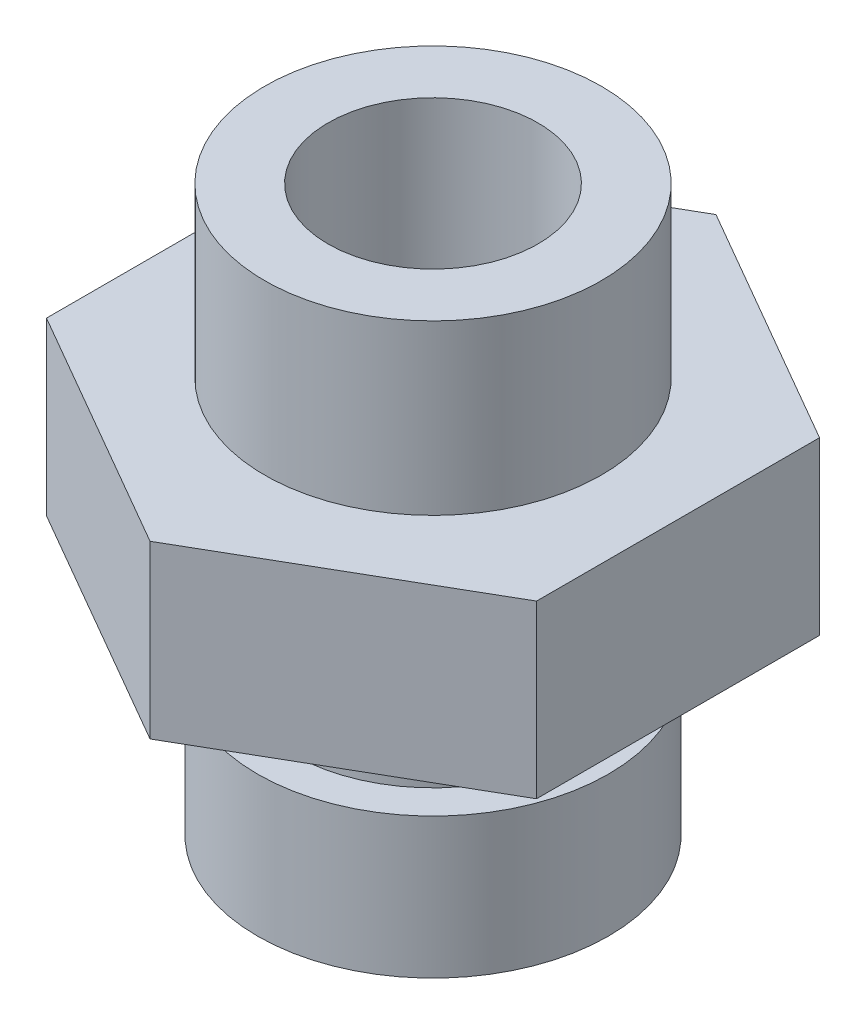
ISO-10303-21;
HEADER;
FILE_DESCRIPTION(('STEP AP214'),'2;1');
FILE_NAME('part.step','',(''),(''),'','','');
FILE_SCHEMA(('AUTOMOTIVE_DESIGN { 1 0 10303 214 1 1 1 1 }'));
ENDSEC;
DATA;
#1=APPLICATION_CONTEXT('core data for automotive mechanical design processes');
#2=APPLICATION_PROTOCOL_DEFINITION('international standard','automotive_design',2000,#1);
#3=PRODUCT_CONTEXT('',#1,'mechanical');
#4=PRODUCT('Part','Part','',(#3));
#5=PRODUCT_RELATED_PRODUCT_CATEGORY('part','',(#4));
#6=PRODUCT_DEFINITION_FORMATION('','',#4);
#7=PRODUCT_DEFINITION_CONTEXT('part definition',#1,'design');
#8=PRODUCT_DEFINITION('design','',#6,#7);
#9=PRODUCT_DEFINITION_SHAPE('','',#8);
#10=(LENGTH_UNIT() NAMED_UNIT(*) SI_UNIT(.MILLI.,.METRE.));
#11=(NAMED_UNIT(*) PLANE_ANGLE_UNIT() SI_UNIT($,.RADIAN.));
#12=(NAMED_UNIT(*) SI_UNIT($,.STERADIAN.) SOLID_ANGLE_UNIT());
#13=UNCERTAINTY_MEASURE_WITH_UNIT(LENGTH_MEASURE(1.E-05),#10,'distance_accuracy_value','');
#14=(GEOMETRIC_REPRESENTATION_CONTEXT(3) GLOBAL_UNCERTAINTY_ASSIGNED_CONTEXT((#13)) GLOBAL_UNIT_ASSIGNED_CONTEXT((#10,
#11,#12)) REPRESENTATION_CONTEXT('',''));
#15=CARTESIAN_POINT('',(0.,0.,0.));
#16=DIRECTION('',(0.,0.,1.));
#17=DIRECTION('',(1.,0.,0.));
#18=AXIS2_PLACEMENT_3D('',#15,#16,#17);
#19=CARTESIAN_POINT('',(0.,-5.08,0.));
#20=DIRECTION('',(0.,1.,0.));
#21=DIRECTION('',(0.,0.,1.));
#22=AXIS2_PLACEMENT_3D('',#19,#20,#21);
#23=CYLINDRICAL_SURFACE('',#22,1.7272);
#24=CARTESIAN_POINT('',(0.,-5.08,0.));
#25=DIRECTION('',(0.,1.,0.));
#26=DIRECTION('',(0.,0.,1.));
#27=AXIS2_PLACEMENT_3D('',#24,#25,#26);
#28=CIRCLE('',#27,1.7272);
#29=CARTESIAN_POINT('',(0.,-5.08,1.7272));
#30=VERTEX_POINT('',#29);
#31=EDGE_CURVE('E309',#30,#30,#28,.T.);
#32=ORIENTED_EDGE('',*,*,#31,.F.);
#33=EDGE_LOOP('',(#32));
#34=FACE_BOUND('',#33,.T.);
#35=CARTESIAN_POINT('',(0.,2.6035,0.));
#36=DIRECTION('',(0.,1.,0.));
#37=DIRECTION('',(0.,0.,1.));
#38=AXIS2_PLACEMENT_3D('',#35,#36,#37);
#39=CIRCLE('',#38,1.7272);
#40=CARTESIAN_POINT('',(0.,2.6035,1.7272));
#41=VERTEX_POINT('',#40);
#42=EDGE_CURVE('E38',#41,#41,#39,.F.);
#43=ORIENTED_EDGE('',*,*,#42,.F.);
#44=EDGE_LOOP('',(#43));
#45=FACE_BOUND('',#44,.T.);
#46=ADVANCED_FACE('F34',(#34,#45),#23,.F.);
#47=CARTESIAN_POINT('',(-5.54355000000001,3.8735,-3.20057008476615));
#48=DIRECTION('',(0.,1.,0.));
#49=DIRECTION('',(0.,0.,1.));
#50=AXIS2_PLACEMENT_3D('',#47,#48,#49);
#51=PLANE('',#50);
#52=DIRECTION('',(0.,0.,1.));
#53=VECTOR('',#52,1.);
#54=CARTESIAN_POINT('',(-5.54355000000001,3.8735,3.20057008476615));
#55=LINE('',#54,#53);
#56=CARTESIAN_POINT('',(-5.54355000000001,3.8735,-3.20057008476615));
#57=VERTEX_POINT('',#56);
#58=CARTESIAN_POINT('',(-5.54355000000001,3.8735,3.20057008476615));
#59=VERTEX_POINT('',#58);
#60=EDGE_CURVE('E125',#57,#59,#55,.T.);
#61=ORIENTED_EDGE('',*,*,#60,.T.);
#62=DIRECTION('',(0.866025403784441,0.,0.499999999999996));
#63=VECTOR('',#62,1.);
#64=CARTESIAN_POINT('',(-2.77177499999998,3.8735,4.80085512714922));
#65=LINE('',#64,#63);
#66=CARTESIAN_POINT('',(0.,3.8735,6.40114016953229));
#67=VERTEX_POINT('',#66);
#68=EDGE_CURVE('E102',#59,#67,#65,.T.);
#69=ORIENTED_EDGE('',*,*,#68,.T.);
#70=DIRECTION('',(0.866025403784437,0.,-0.500000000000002));
#71=VECTOR('',#70,1.);
#72=CARTESIAN_POINT('',(2.77177499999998,3.8735,4.80085512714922));
#73=LINE('',#72,#71);
#74=CARTESIAN_POINT('',(5.54354999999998,3.8735,3.20057008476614));
#75=VERTEX_POINT('',#74);
#76=EDGE_CURVE('E128',#67,#75,#73,.T.);
#77=ORIENTED_EDGE('',*,*,#76,.T.);
#78=DIRECTION('',(0.,0.,-1.));
#79=VECTOR('',#78,1.);
#80=CARTESIAN_POINT('',(5.54354999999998,3.8735,3.20057008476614));
#81=LINE('',#80,#79);
#82=CARTESIAN_POINT('',(5.54354999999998,3.8735,-3.20057008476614));
#83=VERTEX_POINT('',#82);
#84=EDGE_CURVE('E130',#75,#83,#81,.T.);
#85=ORIENTED_EDGE('',*,*,#84,.T.);
#86=DIRECTION('',(-0.866025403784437,0.,-0.500000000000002));
#87=VECTOR('',#86,1.);
#88=CARTESIAN_POINT('',(2.77177499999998,3.8735,-4.80085512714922));
#89=LINE('',#88,#87);
#90=CARTESIAN_POINT('',(0.,3.8735,-6.40114016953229));
#91=VERTEX_POINT('',#90);
#92=EDGE_CURVE('E55',#83,#91,#89,.T.);
#93=ORIENTED_EDGE('',*,*,#92,.T.);
#94=DIRECTION('',(-0.86602540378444,0.,0.499999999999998));
#95=VECTOR('',#94,1.);
#96=CARTESIAN_POINT('',(-2.77177499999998,3.8735,-4.80085512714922));
#97=LINE('',#96,#95);
#98=EDGE_CURVE('E50',#91,#57,#97,.T.);
#99=ORIENTED_EDGE('',*,*,#98,.T.);
#100=EDGE_LOOP('',(#61,#69,#77,#85,#93,#99));
#101=FACE_BOUND('',#100,.T.);
#102=CARTESIAN_POINT('',(0.,3.8735,0.));
#103=DIRECTION('',(0.,1.,0.));
#104=DIRECTION('',(0.,0.,1.));
#105=AXIS2_PLACEMENT_3D('',#102,#103,#104);
#106=CIRCLE('',#105,3.81);
#107=CARTESIAN_POINT('',(0.,3.8735,-3.81));
#108=VERTEX_POINT('',#107);
#109=EDGE_CURVE('E312',#108,#108,#106,.T.);
#110=ORIENTED_EDGE('',*,*,#109,.F.);
#111=EDGE_LOOP('',(#110));
#112=FACE_BOUND('',#111,.T.);
#113=ADVANCED_FACE('F149',(#101,#112),#51,.T.);
#114=CARTESIAN_POINT('',(-5.54355000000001,0.,-3.20057008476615));
#115=DIRECTION('',(0.,1.,0.));
#116=DIRECTION('',(0.,0.,1.));
#117=AXIS2_PLACEMENT_3D('',#114,#115,#116);
#118=PLANE('',#117);
#119=DIRECTION('',(0.,0.,1.));
#120=VECTOR('',#119,1.);
#121=CARTESIAN_POINT('',(-5.54355000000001,0.,3.20057008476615));
#122=LINE('',#121,#120);
#123=CARTESIAN_POINT('',(-5.54355000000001,0.,-3.20057008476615));
#124=VERTEX_POINT('',#123);
#125=CARTESIAN_POINT('',(-5.54355000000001,0.,3.20057008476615));
#126=VERTEX_POINT('',#125);
#127=EDGE_CURVE('E93',#124,#126,#122,.T.);
#128=ORIENTED_EDGE('',*,*,#127,.F.);
#129=DIRECTION('',(-0.866025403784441,0.,0.499999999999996));
#130=VECTOR('',#129,1.);
#131=CARTESIAN_POINT('',(-2.77177499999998,0.,-4.80085512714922));
#132=LINE('',#131,#130);
#133=CARTESIAN_POINT('',(0.,0.,-6.40114016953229));
#134=VERTEX_POINT('',#133);
#135=EDGE_CURVE('E123',#134,#124,#132,.T.);
#136=ORIENTED_EDGE('',*,*,#135,.F.);
#137=DIRECTION('',(-0.866025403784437,0.,-0.500000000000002));
#138=VECTOR('',#137,1.);
#139=CARTESIAN_POINT('',(2.77177499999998,0.,-4.80085512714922));
#140=LINE('',#139,#138);
#141=CARTESIAN_POINT('',(5.54354999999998,0.,-3.20057008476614));
#142=VERTEX_POINT('',#141);
#143=EDGE_CURVE('E120',#142,#134,#140,.T.);
#144=ORIENTED_EDGE('',*,*,#143,.F.);
#145=DIRECTION('',(0.,0.,-1.));
#146=VECTOR('',#145,1.);
#147=CARTESIAN_POINT('',(5.54354999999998,0.,3.20057008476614));
#148=LINE('',#147,#146);
#149=CARTESIAN_POINT('',(5.54354999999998,0.,3.20057008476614));
#150=VERTEX_POINT('',#149);
#151=EDGE_CURVE('E117',#150,#142,#148,.T.);
#152=ORIENTED_EDGE('',*,*,#151,.F.);
#153=DIRECTION('',(0.866025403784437,0.,-0.500000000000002));
#154=VECTOR('',#153,1.);
#155=CARTESIAN_POINT('',(2.77177499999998,0.,4.80085512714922));
#156=LINE('',#155,#154);
#157=CARTESIAN_POINT('',(0.,0.,6.40114016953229));
#158=VERTEX_POINT('',#157);
#159=EDGE_CURVE('E95',#158,#150,#156,.T.);
#160=ORIENTED_EDGE('',*,*,#159,.F.);
#161=DIRECTION('',(0.86602540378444,0.,0.499999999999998));
#162=VECTOR('',#161,1.);
#163=CARTESIAN_POINT('',(-2.77177499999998,0.,4.80085512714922));
#164=LINE('',#163,#162);
#165=EDGE_CURVE('E88',#126,#158,#164,.T.);
#166=ORIENTED_EDGE('',*,*,#165,.F.);
#167=EDGE_LOOP('',(#128,#136,#144,#152,#160,#166));
#168=FACE_BOUND('',#167,.T.);
#169=CARTESIAN_POINT('',(0.,0.,0.));
#170=DIRECTION('',(0.,1.,0.));
#171=DIRECTION('',(0.,0.,1.));
#172=AXIS2_PLACEMENT_3D('',#169,#170,#171);
#173=CIRCLE('',#172,3.1877);
#174=CARTESIAN_POINT('',(0.,0.,3.1877));
#175=VERTEX_POINT('',#174);
#176=EDGE_CURVE('E11',#175,#175,#173,.F.);
#177=ORIENTED_EDGE('',*,*,#176,.F.);
#178=EDGE_LOOP('',(#177));
#179=FACE_BOUND('',#178,.T.);
#180=ADVANCED_FACE('F90',(#168,#179),#118,.F.);
#181=CARTESIAN_POINT('',(-5.54355000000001,3.8735,3.20057008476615));
#182=DIRECTION('',(1.,0.,0.));
#183=DIRECTION('',(0.,0.,-1.));
#184=AXIS2_PLACEMENT_3D('',#181,#182,#183);
#185=PLANE('',#184);
#186=ORIENTED_EDGE('',*,*,#127,.T.);
#187=DIRECTION('',(0.,-1.,0.));
#188=VECTOR('',#187,1.);
#189=CARTESIAN_POINT('',(-5.54355000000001,3.8735,3.20057008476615));
#190=LINE('',#189,#188);
#191=EDGE_CURVE('E43',#59,#126,#190,.T.);
#192=ORIENTED_EDGE('',*,*,#191,.F.);
#193=ORIENTED_EDGE('',*,*,#60,.F.);
#194=DIRECTION('',(0.,-1.,0.));
#195=VECTOR('',#194,1.);
#196=CARTESIAN_POINT('',(-5.54355000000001,3.8735,-3.20057008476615));
#197=LINE('',#196,#195);
#198=EDGE_CURVE('E108',#57,#124,#197,.T.);
#199=ORIENTED_EDGE('',*,*,#198,.T.);
#200=EDGE_LOOP('',(#186,#192,#193,#199));
#201=FACE_BOUND('',#200,.T.);
#202=ADVANCED_FACE('F36',(#201),#185,.F.);
#203=CARTESIAN_POINT('',(-2.77177499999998,3.8735,4.80085512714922));
#204=DIRECTION('',(0.499999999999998,0.,-0.86602540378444));
#205=DIRECTION('',(-0.86602540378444,0.,-0.499999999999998));
#206=AXIS2_PLACEMENT_3D('',#203,#204,#205);
#207=PLANE('',#206);
#208=ORIENTED_EDGE('',*,*,#165,.T.);
#209=DIRECTION('',(0.,-1.,0.));
#210=VECTOR('',#209,1.);
#211=CARTESIAN_POINT('',(0.,3.8735,6.40114016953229));
#212=LINE('',#211,#210);
#213=EDGE_CURVE('E105',#67,#158,#212,.T.);
#214=ORIENTED_EDGE('',*,*,#213,.F.);
#215=ORIENTED_EDGE('',*,*,#68,.F.);
#216=ORIENTED_EDGE('',*,*,#191,.T.);
#217=EDGE_LOOP('',(#208,#214,#215,#216));
#218=FACE_BOUND('',#217,.T.);
#219=ADVANCED_FACE('F101',(#218),#207,.F.);
#220=CARTESIAN_POINT('',(2.77177499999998,3.8735,4.80085512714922));
#221=DIRECTION('',(-0.500000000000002,0.,-0.866025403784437));
#222=DIRECTION('',(-0.866025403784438,0.,0.500000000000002));
#223=AXIS2_PLACEMENT_3D('',#220,#221,#222);
#224=PLANE('',#223);
#225=ORIENTED_EDGE('',*,*,#159,.T.);
#226=DIRECTION('',(0.,-1.,0.));
#227=VECTOR('',#226,1.);
#228=CARTESIAN_POINT('',(5.54354999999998,3.8735,3.20057008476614));
#229=LINE('',#228,#227);
#230=EDGE_CURVE('E141',#75,#150,#229,.T.);
#231=ORIENTED_EDGE('',*,*,#230,.F.);
#232=ORIENTED_EDGE('',*,*,#76,.F.);
#233=ORIENTED_EDGE('',*,*,#213,.T.);
#234=EDGE_LOOP('',(#225,#231,#232,#233));
#235=FACE_BOUND('',#234,.T.);
#236=ADVANCED_FACE('F146',(#235),#224,.F.);
#237=CARTESIAN_POINT('',(5.54354999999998,3.8735,3.20057008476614));
#238=DIRECTION('',(-1.,0.,0.));
#239=DIRECTION('',(0.,0.,1.));
#240=AXIS2_PLACEMENT_3D('',#237,#238,#239);
#241=PLANE('',#240);
#242=ORIENTED_EDGE('',*,*,#151,.T.);
#243=DIRECTION('',(0.,-1.,0.));
#244=VECTOR('',#243,1.);
#245=CARTESIAN_POINT('',(5.54354999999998,3.8735,-3.20057008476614));
#246=LINE('',#245,#244);
#247=EDGE_CURVE('E138',#83,#142,#246,.T.);
#248=ORIENTED_EDGE('',*,*,#247,.F.);
#249=ORIENTED_EDGE('',*,*,#84,.F.);
#250=ORIENTED_EDGE('',*,*,#230,.T.);
#251=EDGE_LOOP('',(#242,#248,#249,#250));
#252=FACE_BOUND('',#251,.T.);
#253=ADVANCED_FACE('F153',(#252),#241,.F.);
#254=CARTESIAN_POINT('',(2.77177499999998,3.8735,-4.80085512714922));
#255=DIRECTION('',(-0.500000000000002,0.,0.866025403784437));
#256=DIRECTION('',(0.866025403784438,0.,0.500000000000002));
#257=AXIS2_PLACEMENT_3D('',#254,#255,#256);
#258=PLANE('',#257);
#259=ORIENTED_EDGE('',*,*,#143,.T.);
#260=DIRECTION('',(0.,-1.,0.));
#261=VECTOR('',#260,1.);
#262=CARTESIAN_POINT('',(0.,3.8735,-6.40114016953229));
#263=LINE('',#262,#261);
#264=EDGE_CURVE('E135',#91,#134,#263,.T.);
#265=ORIENTED_EDGE('',*,*,#264,.F.);
#266=ORIENTED_EDGE('',*,*,#92,.F.);
#267=ORIENTED_EDGE('',*,*,#247,.T.);
#268=EDGE_LOOP('',(#259,#265,#266,#267));
#269=FACE_BOUND('',#268,.T.);
#270=ADVANCED_FACE('F155',(#269),#258,.F.);
#271=CARTESIAN_POINT('',(-2.77177499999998,3.8735,-4.80085512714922));
#272=DIRECTION('',(0.499999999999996,0.,0.866025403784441));
#273=DIRECTION('',(0.866025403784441,0.,-0.499999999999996));
#274=AXIS2_PLACEMENT_3D('',#271,#272,#273);
#275=PLANE('',#274);
#276=ORIENTED_EDGE('',*,*,#135,.T.);
#277=ORIENTED_EDGE('',*,*,#198,.F.);
#278=ORIENTED_EDGE('',*,*,#98,.F.);
#279=ORIENTED_EDGE('',*,*,#264,.T.);
#280=EDGE_LOOP('',(#276,#277,#278,#279));
#281=FACE_BOUND('',#280,.T.);
#282=ADVANCED_FACE('F157',(#281),#275,.F.);
#283=CARTESIAN_POINT('',(0.,-1.905,0.));
#284=DIRECTION('',(0.,1.,0.));
#285=DIRECTION('',(0.,0.,1.));
#286=AXIS2_PLACEMENT_3D('',#283,#284,#285);
#287=CYLINDRICAL_SURFACE('',#286,3.1877);
#288=CARTESIAN_POINT('',(0.,-1.905,0.));
#289=DIRECTION('',(0.,-1.,0.));
#290=DIRECTION('',(0.,0.,-1.));
#291=AXIS2_PLACEMENT_3D('',#288,#289,#290);
#292=CIRCLE('',#291,3.1877);
#293=CARTESIAN_POINT('',(0.,-1.905,3.1877));
#294=VERTEX_POINT('',#293);
#295=EDGE_CURVE('E109',#294,#294,#292,.T.);
#296=CARTESIAN_POINT('',(0.,-1.905,3.1877));
#297=CARTESIAN_POINT('',(0.,-1.88515625,3.1877));
#298=CARTESIAN_POINT('',(0.,-1.8653125,3.1877));
#299=CARTESIAN_POINT('',(0.,-1.825625,3.1877));
#300=CARTESIAN_POINT('',(0.,-1.80578125,3.1877));
#301=CARTESIAN_POINT('',(0.,-1.76609375,3.1877));
#302=CARTESIAN_POINT('',(0.,-1.74625,3.1877));
#303=CARTESIAN_POINT('',(0.,-1.7065625,3.1877));
#304=CARTESIAN_POINT('',(0.,-1.68671875,3.1877));
#305=CARTESIAN_POINT('',(0.,-1.64703125,3.1877));
#306=CARTESIAN_POINT('',(0.,-1.6271875,3.1877));
#307=CARTESIAN_POINT('',(0.,-1.5875,3.1877));
#308=CARTESIAN_POINT('',(0.,-1.56765625,3.1877));
#309=CARTESIAN_POINT('',(0.,-1.52796875,3.1877));
#310=CARTESIAN_POINT('',(0.,-1.508125,3.1877));
#311=CARTESIAN_POINT('',(0.,-1.4684375,3.1877));
#312=CARTESIAN_POINT('',(0.,-1.44859375,3.1877));
#313=CARTESIAN_POINT('',(0.,-1.40890625,3.1877));
#314=CARTESIAN_POINT('',(0.,-1.3890625,3.1877));
#315=CARTESIAN_POINT('',(0.,-1.349375,3.1877));
#316=CARTESIAN_POINT('',(0.,-1.32953125,3.1877));
#317=CARTESIAN_POINT('',(0.,-1.28984375,3.1877));
#318=CARTESIAN_POINT('',(0.,-1.27,3.1877));
#319=CARTESIAN_POINT('',(0.,-1.2303125,3.1877));
#320=CARTESIAN_POINT('',(0.,-1.21046875,3.1877));
#321=CARTESIAN_POINT('',(0.,-1.17078125,3.1877));
#322=CARTESIAN_POINT('',(0.,-1.1509375,3.1877));
#323=CARTESIAN_POINT('',(0.,-1.11125,3.1877));
#324=CARTESIAN_POINT('',(0.,-1.09140625,3.1877));
#325=CARTESIAN_POINT('',(0.,-1.05171875,3.1877));
#326=CARTESIAN_POINT('',(0.,-1.031875,3.1877));
#327=CARTESIAN_POINT('',(0.,-0.9921875,3.1877));
#328=CARTESIAN_POINT('',(0.,-0.97234375,3.1877));
#329=CARTESIAN_POINT('',(0.,-0.93265625,3.1877));
#330=CARTESIAN_POINT('',(0.,-0.9128125,3.1877));
#331=CARTESIAN_POINT('',(0.,-0.873125,3.1877));
#332=CARTESIAN_POINT('',(0.,-0.85328125,3.1877));
#333=CARTESIAN_POINT('',(0.,-0.81359375,3.1877));
#334=CARTESIAN_POINT('',(0.,-0.79375,3.1877));
#335=CARTESIAN_POINT('',(0.,-0.7540625,3.1877));
#336=CARTESIAN_POINT('',(0.,-0.73421875,3.1877));
#337=CARTESIAN_POINT('',(0.,-0.69453125,3.1877));
#338=CARTESIAN_POINT('',(0.,-0.6746875,3.1877));
#339=CARTESIAN_POINT('',(0.,-0.635,3.1877));
#340=CARTESIAN_POINT('',(0.,-0.61515625,3.1877));
#341=CARTESIAN_POINT('',(0.,-0.57546875,3.1877));
#342=CARTESIAN_POINT('',(0.,-0.555625,3.1877));
#343=CARTESIAN_POINT('',(0.,-0.5159375,3.1877));
#344=CARTESIAN_POINT('',(0.,-0.49609375,3.1877));
#345=CARTESIAN_POINT('',(0.,-0.45640625,3.1877));
#346=CARTESIAN_POINT('',(0.,-0.4365625,3.1877));
#347=CARTESIAN_POINT('',(0.,-0.396875,3.1877));
#348=CARTESIAN_POINT('',(0.,-0.37703125,3.1877));
#349=CARTESIAN_POINT('',(0.,-0.33734375,3.1877));
#350=CARTESIAN_POINT('',(0.,-0.3175,3.1877));
#351=CARTESIAN_POINT('',(0.,-0.2778125,3.1877));
#352=CARTESIAN_POINT('',(0.,-0.25796875,3.1877));
#353=CARTESIAN_POINT('',(0.,-0.21828125,3.1877));
#354=CARTESIAN_POINT('',(0.,-0.1984375,3.1877));
#355=CARTESIAN_POINT('',(0.,-0.15875,3.1877));
#356=CARTESIAN_POINT('',(0.,-0.13890625,3.1877));
#357=CARTESIAN_POINT('',(0.,-0.09921875,3.1877));
#358=CARTESIAN_POINT('',(0.,-0.0793749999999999,3.1877));
#359=CARTESIAN_POINT('',(0.,-0.0396874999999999,3.1877));
#360=CARTESIAN_POINT('',(0.,-0.01984375,3.1877));
#361=CARTESIAN_POINT('',(0.,0.,3.1877));
#362=B_SPLINE_CURVE_WITH_KNOTS('',3,(#296,#297,#298,#299,#300,#301,#302,#303,#304,#305,#306,
#307,#308,#309,#310,#311,#312,#313,#314,#315,#316,#317,#318,#319,#320,#321,#322,#323,#324,#325,
#326,#327,#328,#329,#330,#331,#332,#333,#334,#335,#336,#337,#338,#339,#340,#341,#342,#343,#344,
#345,#346,#347,#348,#349,#350,#351,#352,#353,#354,#355,#356,#357,#358,#359,#360,#361),
.UNSPECIFIED.,.F.,.F.,(4,2,2,2,2,2,2,2,2,2,2,2,2,2,2,2,2,2,2,2,2,2,2,2,2,2,2,2,2,2,2,2,4),(0.,
0.0595312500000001,0.1190625,0.17859375,0.238125,0.29765625,0.3571875,0.41671875,0.47625,
0.53578125,0.5953125,0.65484375,0.714375,0.77390625,0.8334375,0.89296875,0.9525,1.01203125,
1.0715625,1.13109375,1.190625,1.25015625,1.3096875,1.36921875,1.42875,1.48828125,1.5478125,
1.60734375,1.666875,1.72640625,1.7859375,1.84546875,1.905),.UNSPECIFIED.);
#363=EDGE_CURVE('BSEAM159',#294,#175,#362,.T.);
#364=ORIENTED_EDGE('',*,*,#295,.F.);
#365=ORIENTED_EDGE('',*,*,#176,.T.);
#366=ORIENTED_EDGE('',*,*,#363,.T.);
#367=ORIENTED_EDGE('',*,*,#363,.F.);
#368=EDGE_LOOP('',(#364,#366,#365,#367));
#369=FACE_BOUND('',#368,.T.);
#370=ADVANCED_FACE('F159',(#369),#287,.T.);
#371=CARTESIAN_POINT('',(0.,-1.905,0.));
#372=DIRECTION('',(0.,-1.,0.));
#373=DIRECTION('',(0.,0.,-1.));
#374=AXIS2_PLACEMENT_3D('',#371,#372,#373);
#375=PLANE('',#374);
#376=CARTESIAN_POINT('',(0.,-1.905,0.));
#377=DIRECTION('',(0.,-1.,0.));
#378=DIRECTION('',(0.,0.,-1.));
#379=AXIS2_PLACEMENT_3D('',#376,#377,#378);
#380=CIRCLE('',#379,3.96875);
#381=CARTESIAN_POINT('',(0.,-1.905,-3.96875));
#382=VERTEX_POINT('',#381);
#383=EDGE_CURVE('E318',#382,#382,#380,.T.);
#384=ORIENTED_EDGE('',*,*,#383,.F.);
#385=EDGE_LOOP('',(#384));
#386=FACE_BOUND('',#385,.T.);
#387=ORIENTED_EDGE('',*,*,#295,.T.);
#388=EDGE_LOOP('',(#387));
#389=FACE_BOUND('',#388,.T.);
#390=ADVANCED_FACE('F165',(#386,#389),#375,.F.);
#391=CARTESIAN_POINT('',(0.,-5.08,0.));
#392=DIRECTION('',(0.,1.,0.));
#393=DIRECTION('',(0.,0.,1.));
#394=AXIS2_PLACEMENT_3D('',#391,#392,#393);
#395=CYLINDRICAL_SURFACE('',#394,3.96875);
#396=CARTESIAN_POINT('',(0.,-5.08,0.));
#397=DIRECTION('',(0.,-1.,0.));
#398=DIRECTION('',(0.,0.,-1.));
#399=AXIS2_PLACEMENT_3D('',#396,#397,#398);
#400=CIRCLE('',#399,3.96875);
#401=CARTESIAN_POINT('',(0.,-5.08,-3.96875));
#402=VERTEX_POINT('',#401);
#403=EDGE_CURVE('E112',#402,#402,#400,.T.);
#404=ORIENTED_EDGE('',*,*,#403,.F.);
#405=EDGE_LOOP('',(#404));
#406=FACE_BOUND('',#405,.T.);
#407=ORIENTED_EDGE('',*,*,#383,.T.);
#408=EDGE_LOOP('',(#407));
#409=FACE_BOUND('',#408,.T.);
#410=ADVANCED_FACE('F194',(#406,#409),#395,.T.);
#411=CARTESIAN_POINT('',(0.,-5.08,0.));
#412=DIRECTION('',(0.,-1.,0.));
#413=DIRECTION('',(0.,0.,-1.));
#414=AXIS2_PLACEMENT_3D('',#411,#412,#413);
#415=PLANE('',#414);
#416=ORIENTED_EDGE('',*,*,#31,.T.);
#417=EDGE_LOOP('',(#416));
#418=FACE_BOUND('',#417,.T.);
#419=ORIENTED_EDGE('',*,*,#403,.T.);
#420=EDGE_LOOP('',(#419));
#421=FACE_BOUND('',#420,.T.);
#422=ADVANCED_FACE('F190',(#418,#421),#415,.T.);
#423=CARTESIAN_POINT('',(0.,7.6835,0.));
#424=DIRECTION('',(0.,-1.,0.));
#425=DIRECTION('',(0.,0.,-1.));
#426=AXIS2_PLACEMENT_3D('',#423,#424,#425);
#427=CYLINDRICAL_SURFACE('',#426,3.81);
#428=CARTESIAN_POINT('',(0.,7.6835,0.));
#429=DIRECTION('',(0.,1.,0.));
#430=DIRECTION('',(0.,0.,1.));
#431=AXIS2_PLACEMENT_3D('',#428,#429,#430);
#432=CIRCLE('',#431,3.81);
#433=CARTESIAN_POINT('',(0.,7.6835,-3.81));
#434=VERTEX_POINT('',#433);
#435=EDGE_CURVE('E315',#434,#434,#432,.T.);
#436=CARTESIAN_POINT('',(0.,7.6835,-3.81));
#437=CARTESIAN_POINT('',(0.,7.6438125,-3.81));
#438=CARTESIAN_POINT('',(0.,7.604125,-3.81));
#439=CARTESIAN_POINT('',(0.,7.52475,-3.81));
#440=CARTESIAN_POINT('',(0.,7.4850625,-3.81));
#441=CARTESIAN_POINT('',(0.,7.4056875,-3.81));
#442=CARTESIAN_POINT('',(0.,7.366,-3.81));
#443=CARTESIAN_POINT('',(0.,7.286625,-3.81));
#444=CARTESIAN_POINT('',(0.,7.2469375,-3.81));
#445=CARTESIAN_POINT('',(0.,7.1675625,-3.81));
#446=CARTESIAN_POINT('',(0.,7.127875,-3.81));
#447=CARTESIAN_POINT('',(0.,7.0485,-3.81));
#448=CARTESIAN_POINT('',(0.,7.0088125,-3.81));
#449=CARTESIAN_POINT('',(0.,6.9294375,-3.81));
#450=CARTESIAN_POINT('',(0.,6.88975,-3.81));
#451=CARTESIAN_POINT('',(0.,6.810375,-3.81));
#452=CARTESIAN_POINT('',(0.,6.7706875,-3.81));
#453=CARTESIAN_POINT('',(0.,6.6913125,-3.81));
#454=CARTESIAN_POINT('',(0.,6.651625,-3.81));
#455=CARTESIAN_POINT('',(0.,6.57225,-3.81));
#456=CARTESIAN_POINT('',(0.,6.5325625,-3.81));
#457=CARTESIAN_POINT('',(0.,6.4531875,-3.81));
#458=CARTESIAN_POINT('',(0.,6.4135,-3.81));
#459=CARTESIAN_POINT('',(0.,6.334125,-3.81));
#460=CARTESIAN_POINT('',(0.,6.2944375,-3.81));
#461=CARTESIAN_POINT('',(0.,6.2150625,-3.81));
#462=CARTESIAN_POINT('',(0.,6.175375,-3.81));
#463=CARTESIAN_POINT('',(0.,6.096,-3.81));
#464=CARTESIAN_POINT('',(0.,6.0563125,-3.81));
#465=CARTESIAN_POINT('',(0.,5.9769375,-3.81));
#466=CARTESIAN_POINT('',(0.,5.93725,-3.81));
#467=CARTESIAN_POINT('',(0.,5.857875,-3.81));
#468=CARTESIAN_POINT('',(0.,5.8181875,-3.81));
#469=CARTESIAN_POINT('',(0.,5.7388125,-3.81));
#470=CARTESIAN_POINT('',(0.,5.699125,-3.81));
#471=CARTESIAN_POINT('',(0.,5.61975,-3.81));
#472=CARTESIAN_POINT('',(0.,5.5800625,-3.81));
#473=CARTESIAN_POINT('',(0.,5.5006875,-3.81));
#474=CARTESIAN_POINT('',(0.,5.461,-3.81));
#475=CARTESIAN_POINT('',(0.,5.381625,-3.81));
#476=CARTESIAN_POINT('',(0.,5.3419375,-3.81));
#477=CARTESIAN_POINT('',(0.,5.2625625,-3.81));
#478=CARTESIAN_POINT('',(0.,5.222875,-3.81));
#479=CARTESIAN_POINT('',(0.,5.1435,-3.81));
#480=CARTESIAN_POINT('',(0.,5.1038125,-3.81));
#481=CARTESIAN_POINT('',(0.,5.0244375,-3.81));
#482=CARTESIAN_POINT('',(0.,4.98475,-3.81));
#483=CARTESIAN_POINT('',(0.,4.905375,-3.81));
#484=CARTESIAN_POINT('',(0.,4.8656875,-3.81));
#485=CARTESIAN_POINT('',(0.,4.7863125,-3.81));
#486=CARTESIAN_POINT('',(0.,4.746625,-3.81));
#487=CARTESIAN_POINT('',(0.,4.66725,-3.81));
#488=CARTESIAN_POINT('',(0.,4.6275625,-3.81));
#489=CARTESIAN_POINT('',(0.,4.5481875,-3.81));
#490=CARTESIAN_POINT('',(0.,4.5085,-3.81));
#491=CARTESIAN_POINT('',(0.,4.429125,-3.81));
#492=CARTESIAN_POINT('',(0.,4.3894375,-3.81));
#493=CARTESIAN_POINT('',(0.,4.3100625,-3.81));
#494=CARTESIAN_POINT('',(0.,4.270375,-3.81));
#495=CARTESIAN_POINT('',(0.,4.191,-3.81));
#496=CARTESIAN_POINT('',(0.,4.1513125,-3.81));
#497=CARTESIAN_POINT('',(0.,4.0719375,-3.81));
#498=CARTESIAN_POINT('',(0.,4.03225,-3.81));
#499=CARTESIAN_POINT('',(0.,3.952875,-3.81));
#500=CARTESIAN_POINT('',(0.,3.9131875,-3.81));
#501=CARTESIAN_POINT('',(0.,3.8735,-3.81));
#502=B_SPLINE_CURVE_WITH_KNOTS('',3,(#436,#437,#438,#439,#440,#441,#442,#443,#444,#445,#446,
#447,#448,#449,#450,#451,#452,#453,#454,#455,#456,#457,#458,#459,#460,#461,#462,#463,#464,#465,
#466,#467,#468,#469,#470,#471,#472,#473,#474,#475,#476,#477,#478,#479,#480,#481,#482,#483,#484,
#485,#486,#487,#488,#489,#490,#491,#492,#493,#494,#495,#496,#497,#498,#499,#500,#501),
.UNSPECIFIED.,.F.,.F.,(4,2,2,2,2,2,2,2,2,2,2,2,2,2,2,2,2,2,2,2,2,2,2,2,2,2,2,2,2,2,2,2,4),(0.,
0.119062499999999,0.238125,0.3571875,0.476249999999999,0.595312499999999,0.714375,
0.833437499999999,0.952499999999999,1.0715625,1.190625,1.3096875,1.42875,1.5478125,1.666875,
1.7859375,1.905,2.0240625,2.143125,2.2621875,2.38125,2.5003125,2.619375,2.7384375,2.8575,
2.9765625,3.095625,3.2146875,3.33375,3.4528125,3.571875,3.6909375,3.81),.UNSPECIFIED.);
#503=EDGE_CURVE('BSEAM186',#434,#108,#502,.T.);
#504=ORIENTED_EDGE('',*,*,#435,.F.);
#505=ORIENTED_EDGE('',*,*,#109,.T.);
#506=ORIENTED_EDGE('',*,*,#503,.T.);
#507=ORIENTED_EDGE('',*,*,#503,.F.);
#508=EDGE_LOOP('',(#504,#506,#505,#507));
#509=FACE_BOUND('',#508,.T.);
#510=ADVANCED_FACE('F186',(#509),#427,.T.);
#511=CARTESIAN_POINT('',(0.,7.6835,0.));
#512=DIRECTION('',(0.,1.,0.));
#513=DIRECTION('',(0.,0.,1.));
#514=AXIS2_PLACEMENT_3D('',#511,#512,#513);
#515=PLANE('',#514);
#516=CARTESIAN_POINT('',(0.,7.6835,0.));
#517=DIRECTION('',(0.,1.,0.));
#518=DIRECTION('',(0.,0.,1.));
#519=AXIS2_PLACEMENT_3D('',#516,#517,#518);
#520=CIRCLE('',#519,2.3749);
#521=CARTESIAN_POINT('',(0.,7.6835,2.3749));
#522=VERTEX_POINT('',#521);
#523=EDGE_CURVE('E305',#522,#522,#520,.T.);
#524=ORIENTED_EDGE('',*,*,#523,.F.);
#525=EDGE_LOOP('',(#524));
#526=FACE_BOUND('',#525,.T.);
#527=ORIENTED_EDGE('',*,*,#435,.T.);
#528=EDGE_LOOP('',(#527));
#529=FACE_BOUND('',#528,.T.);
#530=ADVANCED_FACE('F182',(#526,#529),#515,.T.);
#531=CARTESIAN_POINT('',(0.,2.6035,0.));
#532=DIRECTION('',(0.,1.,0.));
#533=DIRECTION('',(0.,0.,1.));
#534=AXIS2_PLACEMENT_3D('',#531,#532,#533);
#535=PLANE('',#534);
#536=CARTESIAN_POINT('',(0.,2.6035,0.));
#537=DIRECTION('',(0.,1.,0.));
#538=DIRECTION('',(0.,0.,1.));
#539=AXIS2_PLACEMENT_3D('',#536,#537,#538);
#540=CIRCLE('',#539,2.3749);
#541=CARTESIAN_POINT('',(0.,2.6035,2.3749));
#542=VERTEX_POINT('',#541);
#543=EDGE_CURVE('E302',#542,#542,#540,.T.);
#544=ORIENTED_EDGE('',*,*,#543,.T.);
#545=EDGE_LOOP('',(#544));
#546=FACE_BOUND('',#545,.T.);
#547=ORIENTED_EDGE('',*,*,#42,.T.);
#548=EDGE_LOOP('',(#547));
#549=FACE_BOUND('',#548,.T.);
#550=ADVANCED_FACE('F185',(#546,#549),#535,.T.);
#551=CARTESIAN_POINT('',(0.,2.6035,0.));
#552=DIRECTION('',(0.,1.,0.));
#553=DIRECTION('',(0.,0.,1.));
#554=AXIS2_PLACEMENT_3D('',#551,#552,#553);
#555=CYLINDRICAL_SURFACE('',#554,2.3749);
#556=ORIENTED_EDGE('',*,*,#543,.F.);
#557=EDGE_LOOP('',(#556));
#558=FACE_BOUND('',#557,.T.);
#559=ORIENTED_EDGE('',*,*,#523,.T.);
#560=EDGE_LOOP('',(#559));
#561=FACE_BOUND('',#560,.T.);
#562=ADVANCED_FACE('F180',(#558,#561),#555,.F.);
#563=CLOSED_SHELL('',(#46,#113,#180,#202,#219,#236,#253,#270,#282,#370,#390,#410,#422,#510,#530,
#550,#562));
#564=MANIFOLD_SOLID_BREP('B2',#563);
#565=ADVANCED_BREP_SHAPE_REPRESENTATION('',(#18,#564),#14);
#566=SHAPE_DEFINITION_REPRESENTATION(#9,#565);
ENDSEC;
END-ISO-10303-21;
